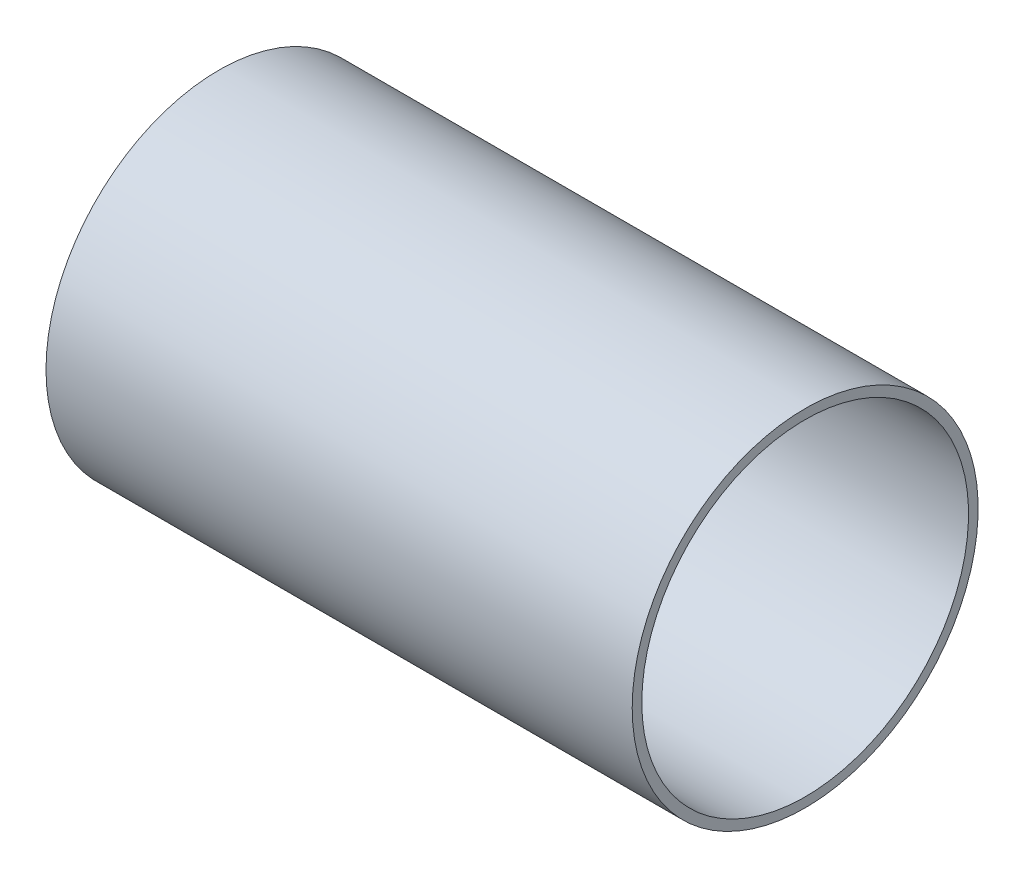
from build123d import *

# Parameters (mm, degrees)
SKETCH2_R      = 114.3
SKETCH2_R_2    = 107.95
EXTRUDE2_DEPTH = 387.35


with BuildPart() as part:
    # Sketch2 → Extrude2 (new body)
    with BuildSketch(Plane(origin=(0, 0, 0), x_dir=(0, 1, 0), z_dir=(-1, 0, 0))):
        with Locations(Location((0, 0, 0), (0, 0, 270))):
            Circle(SKETCH2_R)
        with Locations(Location((0, 0, 0), (0, 0, 270))):
            Circle(SKETCH2_R_2, mode=Mode.SUBTRACT)
    extrude(amount=EXTRUDE2_DEPTH)


solid = part.part
